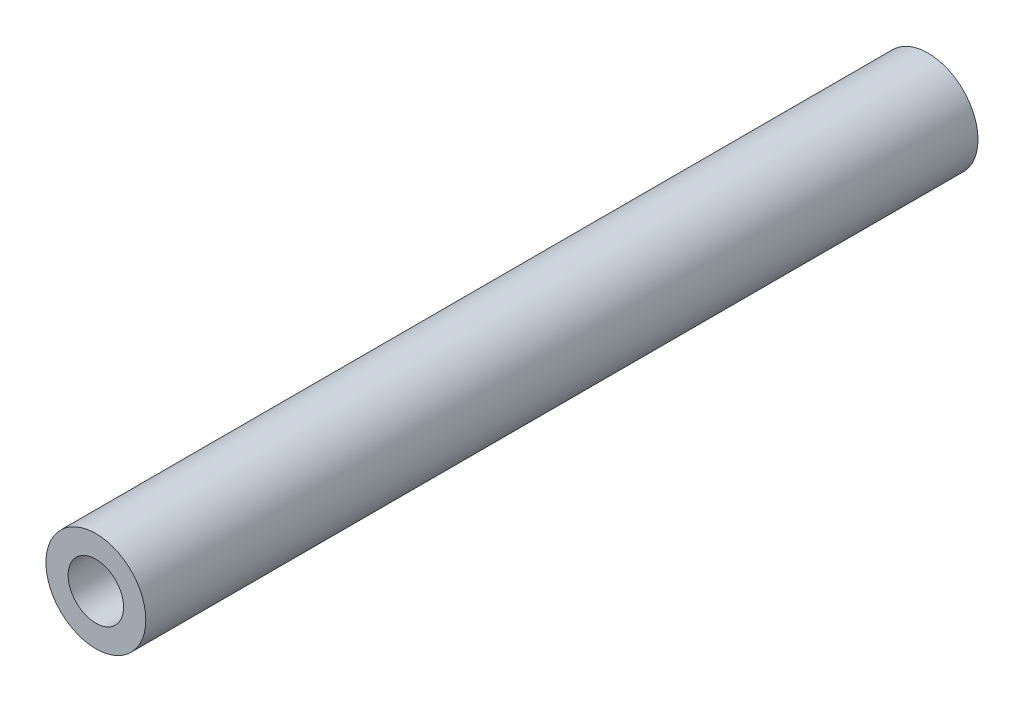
from build123d import *

# Parameters (mm, degrees)
SKETCH1_R           = 22.5
BOSS_EXTRUDE1_DEPTH = 375
SKETCH2_R           = 12.5
CUT_EXTRUDE1_DEPTH  = 370


with BuildPart() as part:
    # Sketch1 → Boss-Extrude1 (new body)
    with BuildSketch(Plane.XY):
        Circle(SKETCH1_R)
    extrude(amount=BOSS_EXTRUDE1_DEPTH)

    # Sketch2 → Cut-Extrude1 (cut)
    with BuildSketch(Plane.XY.offset(375)):
        Circle(SKETCH2_R)
    extrude(amount=-CUT_EXTRUDE1_DEPTH, mode=Mode.SUBTRACT)


solid = part.part
